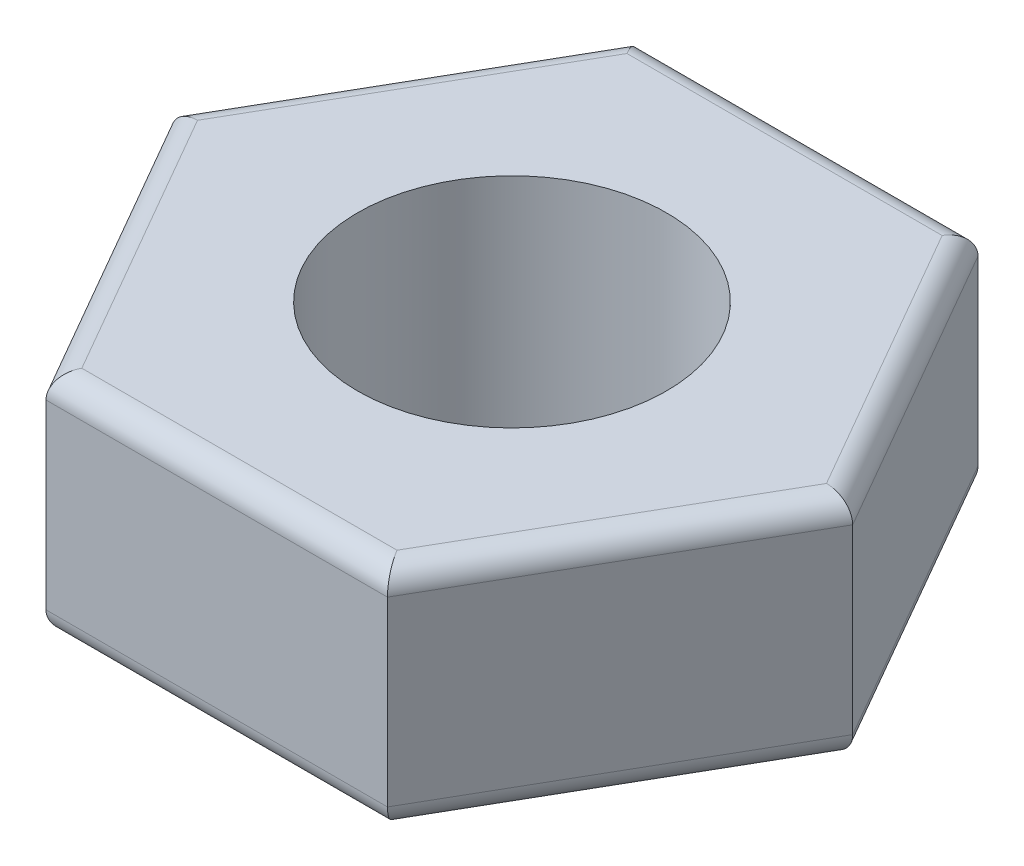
from build123d import *

# Parameters (mm, degrees)
ESQUISSE1_R      = 3.4
EXTRUSION1_DEPTH = 5
CONG_1_R         = 0.5


with BuildPart() as part:
    # Esquisse1 → Extrusion1 (new body)
    with BuildSketch(Plane(origin=(0, 0, 0), x_dir=(1, 0, 0), z_dir=(0, 1, 0))):
        Polygon((-3.758342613, 6.5), (3.758342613, 6.5), (7.5, 0), (3.758342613, -6.5), (-3.758342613, -6.5), (-7.5, 0), align=None)
        with Locations(Location((0, 0, 0), (0, 0, 270))):
            Circle(ESQUISSE1_R, mode=Mode.SUBTRACT)
    extrude(amount=EXTRUSION1_DEPTH)

    # Cong_1
    cong_1_edges = [part.edges().sort_by_distance(p)[0] for p in [
        (5.629171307, 5, -3.25),
        (0, 5, -6.5),
        (-5.629171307, 5, -3.25),
        (-5.629171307, 5, 3.25),
        (0, 5, 6.5),
        (-5.629171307, 0, 3.25),
        (-5.629171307, 0, -3.25),
        (0, 0, -6.5),
        (5.629171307, 0, -3.25),
        (5.629171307, 5, 3.25),
        (5.629171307, 0, 3.25),
        (0, 0, 6.5),
    ]]
    fillet(cong_1_edges, radius=CONG_1_R)


solid = part.part
